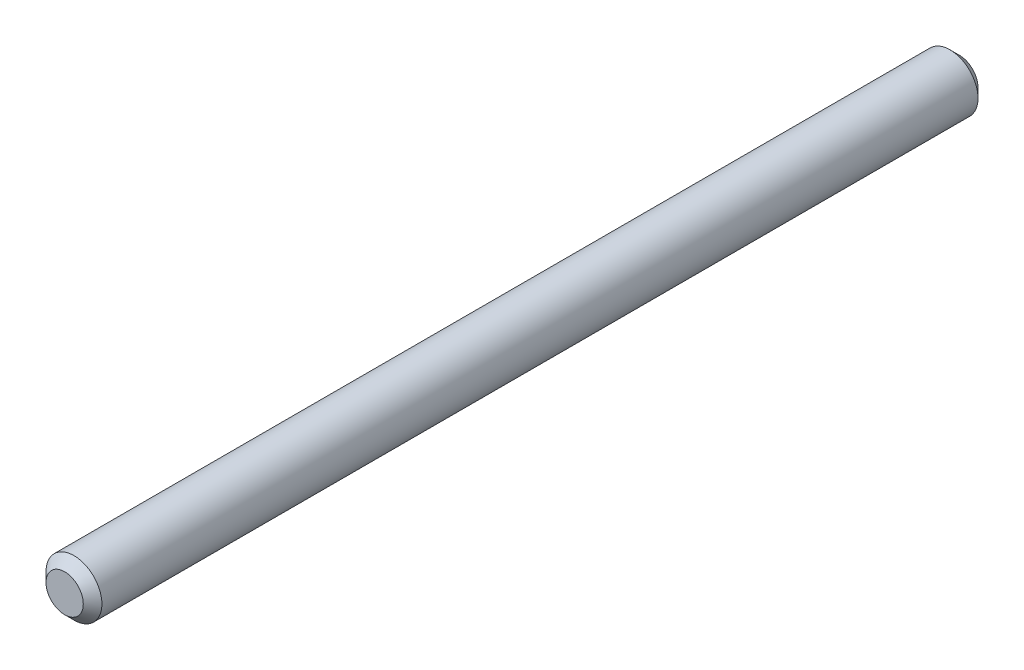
ISO-10303-21;
HEADER;
FILE_DESCRIPTION(('STEP AP214'),'2;1');
FILE_NAME('part.step','',(''),(''),'','','');
FILE_SCHEMA(('AUTOMOTIVE_DESIGN { 1 0 10303 214 1 1 1 1 }'));
ENDSEC;
DATA;
#1=APPLICATION_CONTEXT('core data for automotive mechanical design processes');
#2=APPLICATION_PROTOCOL_DEFINITION('international standard','automotive_design',2000,#1);
#3=PRODUCT_CONTEXT('',#1,'mechanical');
#4=PRODUCT('Part','Part','',(#3));
#5=PRODUCT_RELATED_PRODUCT_CATEGORY('part','',(#4));
#6=PRODUCT_DEFINITION_FORMATION('','',#4);
#7=PRODUCT_DEFINITION_CONTEXT('part definition',#1,'design');
#8=PRODUCT_DEFINITION('design','',#6,#7);
#9=PRODUCT_DEFINITION_SHAPE('','',#8);
#10=(LENGTH_UNIT() NAMED_UNIT(*) SI_UNIT(.MILLI.,.METRE.));
#11=(NAMED_UNIT(*) PLANE_ANGLE_UNIT() SI_UNIT($,.RADIAN.));
#12=(NAMED_UNIT(*) SI_UNIT($,.STERADIAN.) SOLID_ANGLE_UNIT());
#13=UNCERTAINTY_MEASURE_WITH_UNIT(LENGTH_MEASURE(1.E-05),#10,'distance_accuracy_value','');
#14=(GEOMETRIC_REPRESENTATION_CONTEXT(3) GLOBAL_UNCERTAINTY_ASSIGNED_CONTEXT((#13)) GLOBAL_UNIT_ASSIGNED_CONTEXT((#10,
#11,#12)) REPRESENTATION_CONTEXT('',''));
#15=CARTESIAN_POINT('',(0.,0.,0.));
#16=DIRECTION('',(0.,0.,1.));
#17=DIRECTION('',(1.,0.,0.));
#18=AXIS2_PLACEMENT_3D('',#15,#16,#17);
#19=CARTESIAN_POINT('',(0.,0.,48.));
#20=DIRECTION('',(0.,0.,-1.));
#21=DIRECTION('',(-1.,0.,0.));
#22=AXIS2_PLACEMENT_3D('',#19,#20,#21);
#23=CYLINDRICAL_SURFACE('',#22,1.5);
#24=CARTESIAN_POINT('',(0.,0.,47.5));
#25=DIRECTION('',(0.,0.,1.));
#26=DIRECTION('',(1.,0.,0.));
#27=AXIS2_PLACEMENT_3D('',#24,#25,#26);
#28=CIRCLE('',#27,1.5);
#29=CARTESIAN_POINT('',(1.5,0.,47.5));
#30=VERTEX_POINT('',#29);
#31=EDGE_CURVE('E31',#30,#30,#28,.F.);
#32=ORIENTED_EDGE('',*,*,#31,.T.);
#33=EDGE_LOOP('',(#32));
#34=FACE_BOUND('',#33,.T.);
#35=CARTESIAN_POINT('',(0.,0.,0.499999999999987));
#36=DIRECTION('',(0.,0.,1.));
#37=DIRECTION('',(1.,0.,0.));
#38=AXIS2_PLACEMENT_3D('',#35,#36,#37);
#39=CIRCLE('',#38,1.5);
#40=CARTESIAN_POINT('',(1.5,0.,0.499999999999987));
#41=VERTEX_POINT('',#40);
#42=EDGE_CURVE('E35',#41,#41,#39,.T.);
#43=ORIENTED_EDGE('',*,*,#42,.T.);
#44=EDGE_LOOP('',(#43));
#45=FACE_BOUND('',#44,.T.);
#46=ADVANCED_FACE('F25',(#34,#45),#23,.T.);
#47=CARTESIAN_POINT('',(0.,0.,48.));
#48=DIRECTION('',(0.,0.,1.));
#49=DIRECTION('',(1.,0.,0.));
#50=AXIS2_PLACEMENT_3D('',#47,#48,#49);
#51=PLANE('',#50);
#52=CARTESIAN_POINT('',(0.,0.,48.));
#53=DIRECTION('',(0.,0.,1.));
#54=DIRECTION('',(1.,0.,0.));
#55=AXIS2_PLACEMENT_3D('',#52,#53,#54);
#56=CIRCLE('',#55,1.);
#57=CARTESIAN_POINT('',(1.,0.,48.));
#58=VERTEX_POINT('',#57);
#59=EDGE_CURVE('E39',#58,#58,#56,.T.);
#60=ORIENTED_EDGE('',*,*,#59,.T.);
#61=EDGE_LOOP('',(#60));
#62=FACE_BOUND('',#61,.T.);
#63=ADVANCED_FACE('F45',(#62),#51,.T.);
#64=CARTESIAN_POINT('',(0.,0.,0.));
#65=DIRECTION('',(0.,0.,1.));
#66=DIRECTION('',(1.,0.,0.));
#67=AXIS2_PLACEMENT_3D('',#64,#65,#66);
#68=PLANE('',#67);
#69=CARTESIAN_POINT('',(0.,0.,0.));
#70=DIRECTION('',(0.,0.,1.));
#71=DIRECTION('',(1.,0.,0.));
#72=AXIS2_PLACEMENT_3D('',#69,#70,#71);
#73=CIRCLE('',#72,1.00000000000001);
#74=CARTESIAN_POINT('',(1.00000000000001,0.,0.));
#75=VERTEX_POINT('',#74);
#76=EDGE_CURVE('E10',#75,#75,#73,.F.);
#77=ORIENTED_EDGE('',*,*,#76,.T.);
#78=EDGE_LOOP('',(#77));
#79=FACE_BOUND('',#78,.T.);
#80=ADVANCED_FACE('F50',(#79),#68,.F.);
#81=CARTESIAN_POINT('',(0.,0.,48.));
#82=DIRECTION('',(0.,0.,-1.));
#83=DIRECTION('',(-1.,0.,0.));
#84=AXIS2_PLACEMENT_3D('',#81,#82,#83);
#85=CONICAL_SURFACE('',#84,1.,0.78539816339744);
#86=ORIENTED_EDGE('',*,*,#31,.F.);
#87=EDGE_LOOP('',(#86));
#88=FACE_BOUND('',#87,.T.);
#89=ORIENTED_EDGE('',*,*,#59,.F.);
#90=EDGE_LOOP('',(#89));
#91=FACE_BOUND('',#90,.T.);
#92=ADVANCED_FACE('F47',(#88,#91),#85,.T.);
#93=CARTESIAN_POINT('',(0.,0.,0.499999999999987));
#94=DIRECTION('',(0.,0.,1.));
#95=DIRECTION('',(1.,0.,0.));
#96=AXIS2_PLACEMENT_3D('',#93,#94,#95);
#97=CONICAL_SURFACE('',#96,1.5,0.785398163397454);
#98=ORIENTED_EDGE('',*,*,#76,.F.);
#99=EDGE_LOOP('',(#98));
#100=FACE_BOUND('',#99,.T.);
#101=ORIENTED_EDGE('',*,*,#42,.F.);
#102=EDGE_LOOP('',(#101));
#103=FACE_BOUND('',#102,.T.);
#104=ADVANCED_FACE('F49',(#100,#103),#97,.T.);
#105=CLOSED_SHELL('',(#46,#63,#80,#92,#104));
#106=MANIFOLD_SOLID_BREP('B2',#105);
#107=ADVANCED_BREP_SHAPE_REPRESENTATION('',(#18,#106),#14);
#108=SHAPE_DEFINITION_REPRESENTATION(#9,#107);
ENDSEC;
END-ISO-10303-21;
